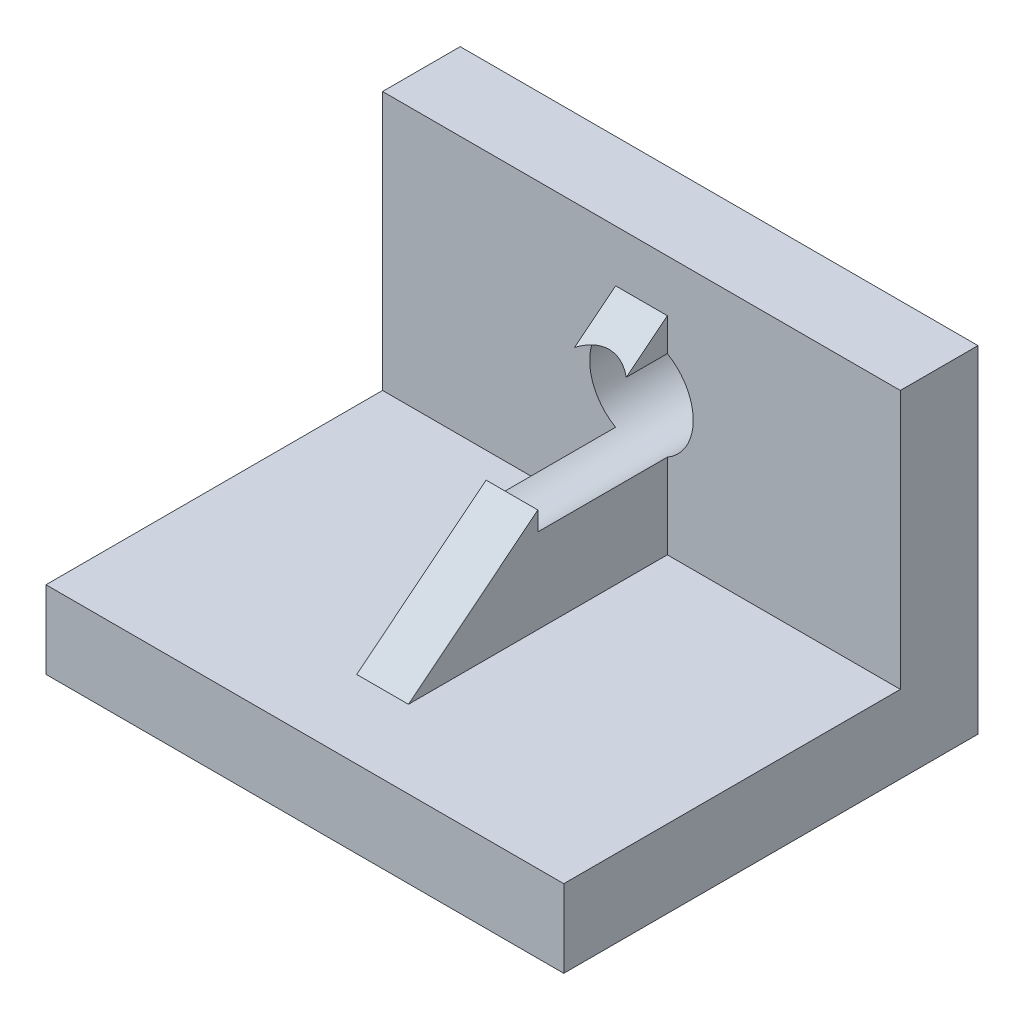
ISO-10303-21;
HEADER;
FILE_DESCRIPTION(('STEP AP214'),'2;1');
FILE_NAME('part.step','',(''),(''),'','','');
FILE_SCHEMA(('AUTOMOTIVE_DESIGN { 1 0 10303 214 1 1 1 1 }'));
ENDSEC;
DATA;
#1=APPLICATION_CONTEXT('core data for automotive mechanical design processes');
#2=APPLICATION_PROTOCOL_DEFINITION('international standard','automotive_design',2000,#1);
#3=PRODUCT_CONTEXT('',#1,'mechanical');
#4=PRODUCT('Part','Part','',(#3));
#5=PRODUCT_RELATED_PRODUCT_CATEGORY('part','',(#4));
#6=PRODUCT_DEFINITION_FORMATION('','',#4);
#7=PRODUCT_DEFINITION_CONTEXT('part definition',#1,'design');
#8=PRODUCT_DEFINITION('design','',#6,#7);
#9=PRODUCT_DEFINITION_SHAPE('','',#8);
#10=(LENGTH_UNIT() NAMED_UNIT(*) SI_UNIT(.MILLI.,.METRE.));
#11=(NAMED_UNIT(*) PLANE_ANGLE_UNIT() SI_UNIT($,.RADIAN.));
#12=(NAMED_UNIT(*) SI_UNIT($,.STERADIAN.) SOLID_ANGLE_UNIT());
#13=UNCERTAINTY_MEASURE_WITH_UNIT(LENGTH_MEASURE(1.E-05),#10,'distance_accuracy_value','');
#14=(GEOMETRIC_REPRESENTATION_CONTEXT(3) GLOBAL_UNCERTAINTY_ASSIGNED_CONTEXT((#13)) GLOBAL_UNIT_ASSIGNED_CONTEXT((#10,
#11,#12)) REPRESENTATION_CONTEXT('',''));
#15=CARTESIAN_POINT('',(0.,0.,0.));
#16=DIRECTION('',(0.,0.,1.));
#17=DIRECTION('',(1.,0.,0.));
#18=AXIS2_PLACEMENT_3D('',#15,#16,#17);
#19=CARTESIAN_POINT('',(-5.,15.,25.));
#20=DIRECTION('',(0.,0.78086880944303,0.624695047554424));
#21=DIRECTION('',(0.,-0.624695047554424,0.78086880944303));
#22=AXIS2_PLACEMENT_3D('',#19,#20,#21);
#23=PLANE('',#22);
#24=CARTESIAN_POINT('',(0.,40.,-6.24999999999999));
#25=DIRECTION('',(0.,0.78086880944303,0.624695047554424));
#26=DIRECTION('',(0.,-0.624695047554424,0.78086880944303));
#27=AXIS2_PLACEMENT_3D('',#24,#25,#26);
#28=ELLIPSE('',#27,16.0078105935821,10.);
#29=CARTESIAN_POINT('',(5.,48.6602540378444,-17.0753175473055));
#30=VERTEX_POINT('',#29);
#31=CARTESIAN_POINT('',(-5.,48.6602540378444,-17.0753175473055));
#32=VERTEX_POINT('',#31);
#33=EDGE_CURVE('E163',#30,#32,#28,.T.);
#34=ORIENTED_EDGE('',*,*,#33,.F.);
#35=DIRECTION('',(0.,-0.624695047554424,0.78086880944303));
#36=VECTOR('',#35,1.);
#37=CARTESIAN_POINT('',(5.,15.,25.));
#38=LINE('',#37,#36);
#39=CARTESIAN_POINT('',(5.,55.,-25.));
#40=VERTEX_POINT('',#39);
#41=EDGE_CURVE('E190',#40,#30,#38,.T.);
#42=ORIENTED_EDGE('',*,*,#41,.F.);
#43=DIRECTION('',(1.,0.,0.));
#44=VECTOR('',#43,1.);
#45=CARTESIAN_POINT('',(-5.,55.,-25.));
#46=LINE('',#45,#44);
#47=CARTESIAN_POINT('',(-5.,55.,-25.));
#48=VERTEX_POINT('',#47);
#49=EDGE_CURVE('E183',#48,#40,#46,.T.);
#50=ORIENTED_EDGE('',*,*,#49,.F.);
#51=DIRECTION('',(0.,-0.624695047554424,0.78086880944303));
#52=VECTOR('',#51,1.);
#53=CARTESIAN_POINT('',(-5.,15.,25.));
#54=LINE('',#53,#52);
#55=EDGE_CURVE('E176',#48,#32,#54,.T.);
#56=ORIENTED_EDGE('',*,*,#55,.T.);
#57=EDGE_LOOP('',(#34,#42,#50,#56));
#58=FACE_BOUND('',#57,.T.);
#59=ADVANCED_FACE('F41',(#58),#23,.T.);
#60=CARTESIAN_POINT('',(-5.,0.,0.));
#61=DIRECTION('',(-1.,0.,0.));
#62=DIRECTION('',(0.,0.,1.));
#63=AXIS2_PLACEMENT_3D('',#60,#61,#62);
#64=PLANE('',#63);
#65=DIRECTION('',(0.,0.,1.));
#66=VECTOR('',#65,1.);
#67=CARTESIAN_POINT('',(-5.,48.6602540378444,-50.));
#68=LINE('',#67,#66);
#69=CARTESIAN_POINT('',(-5.,48.6602540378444,-25.));
#70=VERTEX_POINT('',#69);
#71=EDGE_CURVE('E172',#32,#70,#68,.F.);
#72=ORIENTED_EDGE('',*,*,#71,.F.);
#73=ORIENTED_EDGE('',*,*,#55,.F.);
#74=DIRECTION('',(0.,1.,0.));
#75=VECTOR('',#74,1.);
#76=CARTESIAN_POINT('',(-5.,55.,-25.));
#77=LINE('',#76,#75);
#78=EDGE_CURVE('E180',#70,#48,#77,.T.);
#79=ORIENTED_EDGE('',*,*,#78,.F.);
#80=EDGE_LOOP('',(#72,#73,#79));
#81=FACE_BOUND('',#80,.T.);
#82=ADVANCED_FACE('F261',(#81),#64,.T.);
#83=CARTESIAN_POINT('',(5.,0.,0.));
#84=DIRECTION('',(-1.,0.,0.));
#85=DIRECTION('',(0.,0.,1.));
#86=AXIS2_PLACEMENT_3D('',#83,#84,#85);
#87=PLANE('',#86);
#88=ORIENTED_EDGE('',*,*,#41,.T.);
#89=DIRECTION('',(0.,0.,1.));
#90=VECTOR('',#89,1.);
#91=CARTESIAN_POINT('',(5.,48.6602540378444,-50.));
#92=LINE('',#91,#90);
#93=CARTESIAN_POINT('',(5.,48.6602540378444,-25.));
#94=VERTEX_POINT('',#93);
#95=EDGE_CURVE('E11',#30,#94,#92,.F.);
#96=ORIENTED_EDGE('',*,*,#95,.T.);
#97=DIRECTION('',(0.,1.,0.));
#98=VECTOR('',#97,1.);
#99=CARTESIAN_POINT('',(5.,55.,-25.));
#100=LINE('',#99,#98);
#101=EDGE_CURVE('E64',#94,#40,#100,.T.);
#102=ORIENTED_EDGE('',*,*,#101,.T.);
#103=EDGE_LOOP('',(#88,#96,#102));
#104=FACE_BOUND('',#103,.T.);
#105=ADVANCED_FACE('F289',(#104),#87,.F.);
#106=CARTESIAN_POINT('',(0.,15.,0.));
#107=DIRECTION('',(0.,-1.,0.));
#108=DIRECTION('',(0.,0.,-1.));
#109=AXIS2_PLACEMENT_3D('',#106,#107,#108);
#110=PLANE('',#109);
#111=DIRECTION('',(0.,0.,-1.));
#112=VECTOR('',#111,1.);
#113=CARTESIAN_POINT('',(5.,15.,-25.));
#114=LINE('',#113,#112);
#115=CARTESIAN_POINT('',(5.,15.,25.));
#116=VERTEX_POINT('',#115);
#117=CARTESIAN_POINT('',(5.,15.,-25.));
#118=VERTEX_POINT('',#117);
#119=EDGE_CURVE('E194',#116,#118,#114,.T.);
#120=ORIENTED_EDGE('',*,*,#119,.F.);
#121=DIRECTION('',(1.,0.,0.));
#122=VECTOR('',#121,1.);
#123=CARTESIAN_POINT('',(-5.,15.,25.));
#124=LINE('',#123,#122);
#125=CARTESIAN_POINT('',(-5.,15.,25.));
#126=VERTEX_POINT('',#125);
#127=EDGE_CURVE('E191',#126,#116,#124,.T.);
#128=ORIENTED_EDGE('',*,*,#127,.F.);
#129=DIRECTION('',(0.,0.,-1.));
#130=VECTOR('',#129,1.);
#131=CARTESIAN_POINT('',(-5.,15.,-25.));
#132=LINE('',#131,#130);
#133=CARTESIAN_POINT('',(-5.,15.,-25.));
#134=VERTEX_POINT('',#133);
#135=EDGE_CURVE('E185',#126,#134,#132,.T.);
#136=ORIENTED_EDGE('',*,*,#135,.T.);
#137=DIRECTION('',(1.,0.,0.));
#138=VECTOR('',#137,1.);
#139=CARTESIAN_POINT('',(-50.,15.,-25.));
#140=LINE('',#139,#138);
#141=CARTESIAN_POINT('',(-50.,15.,-25.));
#142=VERTEX_POINT('',#141);
#143=EDGE_CURVE('E204',#142,#134,#140,.T.);
#144=ORIENTED_EDGE('',*,*,#143,.F.);
#145=DIRECTION('',(0.,0.,1.));
#146=VECTOR('',#145,1.);
#147=CARTESIAN_POINT('',(-50.,15.,40.));
#148=LINE('',#147,#146);
#149=CARTESIAN_POINT('',(-50.,15.,40.));
#150=VERTEX_POINT('',#149);
#151=EDGE_CURVE('E224',#142,#150,#148,.T.);
#152=ORIENTED_EDGE('',*,*,#151,.T.);
#153=DIRECTION('',(1.,0.,0.));
#154=VECTOR('',#153,1.);
#155=CARTESIAN_POINT('',(-50.,15.,40.));
#156=LINE('',#155,#154);
#157=CARTESIAN_POINT('',(50.,15.,40.));
#158=VERTEX_POINT('',#157);
#159=EDGE_CURVE('E226',#150,#158,#156,.T.);
#160=ORIENTED_EDGE('',*,*,#159,.T.);
#161=DIRECTION('',(0.,0.,-1.));
#162=VECTOR('',#161,1.);
#163=CARTESIAN_POINT('',(50.,15.,40.));
#164=LINE('',#163,#162);
#165=CARTESIAN_POINT('',(50.,15.,-25.));
#166=VERTEX_POINT('',#165);
#167=EDGE_CURVE('E219',#158,#166,#164,.T.);
#168=ORIENTED_EDGE('',*,*,#167,.T.);
#169=EDGE_CURVE('E197',#118,#166,#140,.T.);
#170=ORIENTED_EDGE('',*,*,#169,.F.);
#171=EDGE_LOOP('',(#120,#128,#136,#144,#152,#160,#168,#170));
#172=FACE_BOUND('',#171,.T.);
#173=ADVANCED_FACE('F264',(#172),#110,.F.);
#174=CARTESIAN_POINT('',(-50.,65.,-25.));
#175=DIRECTION('',(0.,0.,-1.));
#176=DIRECTION('',(-1.,0.,0.));
#177=AXIS2_PLACEMENT_3D('',#174,#175,#176);
#178=PLANE('',#177);
#179=ORIENTED_EDGE('',*,*,#101,.F.);
#180=CARTESIAN_POINT('',(0.,40.,-25.));
#181=DIRECTION('',(0.,0.,-1.));
#182=DIRECTION('',(-1.,0.,0.));
#183=AXIS2_PLACEMENT_3D('',#180,#181,#182);
#184=CIRCLE('',#183,10.);
#185=CARTESIAN_POINT('',(5.,31.3397459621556,-25.));
#186=VERTEX_POINT('',#185);
#187=EDGE_CURVE('E167',#94,#186,#184,.T.);
#188=ORIENTED_EDGE('',*,*,#187,.T.);
#189=EDGE_CURVE('E186',#118,#186,#100,.T.);
#190=ORIENTED_EDGE('',*,*,#189,.F.);
#191=ORIENTED_EDGE('',*,*,#169,.T.);
#192=DIRECTION('',(0.,-1.,0.));
#193=VECTOR('',#192,1.);
#194=CARTESIAN_POINT('',(50.,65.,-25.));
#195=LINE('',#194,#193);
#196=CARTESIAN_POINT('',(50.,65.,-25.));
#197=VERTEX_POINT('',#196);
#198=EDGE_CURVE('E211',#197,#166,#195,.T.);
#199=ORIENTED_EDGE('',*,*,#198,.F.);
#200=DIRECTION('',(1.,0.,0.));
#201=VECTOR('',#200,1.);
#202=CARTESIAN_POINT('',(-50.,65.,-25.));
#203=LINE('',#202,#201);
#204=CARTESIAN_POINT('',(-50.,65.,-25.));
#205=VERTEX_POINT('',#204);
#206=EDGE_CURVE('E207',#205,#197,#203,.T.);
#207=ORIENTED_EDGE('',*,*,#206,.F.);
#208=DIRECTION('',(0.,-1.,0.));
#209=VECTOR('',#208,1.);
#210=CARTESIAN_POINT('',(-50.,65.,-25.));
#211=LINE('',#210,#209);
#212=EDGE_CURVE('E216',#205,#142,#211,.T.);
#213=ORIENTED_EDGE('',*,*,#212,.T.);
#214=ORIENTED_EDGE('',*,*,#143,.T.);
#215=CARTESIAN_POINT('',(-5.,31.3397459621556,-25.));
#216=VERTEX_POINT('',#215);
#217=EDGE_CURVE('E177',#134,#216,#77,.T.);
#218=ORIENTED_EDGE('',*,*,#217,.T.);
#219=EDGE_CURVE('E147',#216,#70,#184,.T.);
#220=ORIENTED_EDGE('',*,*,#219,.T.);
#221=ORIENTED_EDGE('',*,*,#78,.T.);
#222=ORIENTED_EDGE('',*,*,#49,.T.);
#223=EDGE_LOOP('',(#179,#188,#190,#191,#199,#207,#213,#214,#218,#220,#221,#222));
#224=FACE_BOUND('',#223,.T.);
#225=ADVANCED_FACE('F252',(#224),#178,.F.);
#226=CARTESIAN_POINT('',(50.,15.,40.));
#227=DIRECTION('',(-1.,0.,0.));
#228=DIRECTION('',(0.,0.,1.));
#229=AXIS2_PLACEMENT_3D('',#226,#227,#228);
#230=PLANE('',#229);
#231=DIRECTION('',(0.,0.,-1.));
#232=VECTOR('',#231,1.);
#233=CARTESIAN_POINT('',(50.,0.,40.));
#234=LINE('',#233,#232);
#235=CARTESIAN_POINT('',(50.,0.,40.));
#236=VERTEX_POINT('',#235);
#237=CARTESIAN_POINT('',(50.,0.,-40.));
#238=VERTEX_POINT('',#237);
#239=EDGE_CURVE('E218',#236,#238,#234,.T.);
#240=ORIENTED_EDGE('',*,*,#239,.T.);
#241=DIRECTION('',(0.,-1.,0.));
#242=VECTOR('',#241,1.);
#243=CARTESIAN_POINT('',(50.,15.,-40.));
#244=LINE('',#243,#242);
#245=CARTESIAN_POINT('',(50.,65.,-40.));
#246=VERTEX_POINT('',#245);
#247=EDGE_CURVE('E243',#246,#238,#244,.T.);
#248=ORIENTED_EDGE('',*,*,#247,.F.);
#249=DIRECTION('',(0.,0.,-1.));
#250=VECTOR('',#249,1.);
#251=CARTESIAN_POINT('',(50.,65.,-25.));
#252=LINE('',#251,#250);
#253=EDGE_CURVE('E199',#197,#246,#252,.T.);
#254=ORIENTED_EDGE('',*,*,#253,.F.);
#255=ORIENTED_EDGE('',*,*,#198,.T.);
#256=ORIENTED_EDGE('',*,*,#167,.F.);
#257=DIRECTION('',(0.,-1.,0.));
#258=VECTOR('',#257,1.);
#259=CARTESIAN_POINT('',(50.,15.,40.));
#260=LINE('',#259,#258);
#261=EDGE_CURVE('E229',#158,#236,#260,.T.);
#262=ORIENTED_EDGE('',*,*,#261,.T.);
#263=EDGE_LOOP('',(#240,#248,#254,#255,#256,#262));
#264=FACE_BOUND('',#263,.T.);
#265=ADVANCED_FACE('F43',(#264),#230,.F.);
#266=CARTESIAN_POINT('',(-50.,15.,-40.));
#267=DIRECTION('',(0.,0.,1.));
#268=DIRECTION('',(1.,0.,0.));
#269=AXIS2_PLACEMENT_3D('',#266,#267,#268);
#270=PLANE('',#269);
#271=CARTESIAN_POINT('',(0.,40.,-40.));
#272=DIRECTION('',(0.,0.,1.));
#273=DIRECTION('',(1.,0.,0.));
#274=AXIS2_PLACEMENT_3D('',#271,#272,#273);
#275=CIRCLE('',#274,10.);
#276=CARTESIAN_POINT('',(10.,40.,-40.));
#277=VERTEX_POINT('',#276);
#278=EDGE_CURVE('E152',#277,#277,#275,.T.);
#279=ORIENTED_EDGE('',*,*,#278,.T.);
#280=EDGE_LOOP('',(#279));
#281=FACE_BOUND('',#280,.T.);
#282=DIRECTION('',(-1.,0.,0.));
#283=VECTOR('',#282,1.);
#284=CARTESIAN_POINT('',(-50.,0.,-40.));
#285=LINE('',#284,#283);
#286=CARTESIAN_POINT('',(-50.,0.,-40.));
#287=VERTEX_POINT('',#286);
#288=EDGE_CURVE('E232',#238,#287,#285,.T.);
#289=ORIENTED_EDGE('',*,*,#288,.T.);
#290=DIRECTION('',(0.,-1.,0.));
#291=VECTOR('',#290,1.);
#292=CARTESIAN_POINT('',(-50.,15.,-40.));
#293=LINE('',#292,#291);
#294=CARTESIAN_POINT('',(-50.,65.,-40.));
#295=VERTEX_POINT('',#294);
#296=EDGE_CURVE('E241',#295,#287,#293,.T.);
#297=ORIENTED_EDGE('',*,*,#296,.F.);
#298=DIRECTION('',(-1.,0.,0.));
#299=VECTOR('',#298,1.);
#300=CARTESIAN_POINT('',(-50.,65.,-40.));
#301=LINE('',#300,#299);
#302=EDGE_CURVE('E201',#246,#295,#301,.T.);
#303=ORIENTED_EDGE('',*,*,#302,.F.);
#304=ORIENTED_EDGE('',*,*,#247,.T.);
#305=EDGE_LOOP('',(#289,#297,#303,#304));
#306=FACE_BOUND('',#305,.T.);
#307=ADVANCED_FACE('F368',(#281,#306),#270,.F.);
#308=CARTESIAN_POINT('',(-50.,15.,40.));
#309=DIRECTION('',(1.,0.,0.));
#310=DIRECTION('',(0.,0.,-1.));
#311=AXIS2_PLACEMENT_3D('',#308,#309,#310);
#312=PLANE('',#311);
#313=DIRECTION('',(0.,0.,1.));
#314=VECTOR('',#313,1.);
#315=CARTESIAN_POINT('',(-50.,0.,40.));
#316=LINE('',#315,#314);
#317=CARTESIAN_POINT('',(-50.,0.,40.));
#318=VERTEX_POINT('',#317);
#319=EDGE_CURVE('E235',#287,#318,#316,.T.);
#320=ORIENTED_EDGE('',*,*,#319,.T.);
#321=DIRECTION('',(0.,-1.,0.));
#322=VECTOR('',#321,1.);
#323=CARTESIAN_POINT('',(-50.,15.,40.));
#324=LINE('',#323,#322);
#325=EDGE_CURVE('E236',#150,#318,#324,.T.);
#326=ORIENTED_EDGE('',*,*,#325,.F.);
#327=ORIENTED_EDGE('',*,*,#151,.F.);
#328=ORIENTED_EDGE('',*,*,#212,.F.);
#329=DIRECTION('',(0.,0.,1.));
#330=VECTOR('',#329,1.);
#331=CARTESIAN_POINT('',(-50.,65.,-25.));
#332=LINE('',#331,#330);
#333=EDGE_CURVE('E210',#295,#205,#332,.T.);
#334=ORIENTED_EDGE('',*,*,#333,.F.);
#335=ORIENTED_EDGE('',*,*,#296,.T.);
#336=EDGE_LOOP('',(#320,#326,#327,#328,#334,#335));
#337=FACE_BOUND('',#336,.T.);
#338=ADVANCED_FACE('F358',(#337),#312,.F.);
#339=CARTESIAN_POINT('',(-50.,15.,40.));
#340=DIRECTION('',(0.,0.,-1.));
#341=DIRECTION('',(-1.,0.,0.));
#342=AXIS2_PLACEMENT_3D('',#339,#340,#341);
#343=PLANE('',#342);
#344=DIRECTION('',(1.,0.,0.));
#345=VECTOR('',#344,1.);
#346=CARTESIAN_POINT('',(-50.,0.,40.));
#347=LINE('',#346,#345);
#348=EDGE_CURVE('E221',#318,#236,#347,.T.);
#349=ORIENTED_EDGE('',*,*,#348,.T.);
#350=ORIENTED_EDGE('',*,*,#261,.F.);
#351=ORIENTED_EDGE('',*,*,#159,.F.);
#352=ORIENTED_EDGE('',*,*,#325,.T.);
#353=EDGE_LOOP('',(#349,#350,#351,#352));
#354=FACE_BOUND('',#353,.T.);
#355=ADVANCED_FACE('F364',(#354),#343,.F.);
#356=CARTESIAN_POINT('',(0.,0.,0.));
#357=DIRECTION('',(0.,-1.,0.));
#358=DIRECTION('',(0.,0.,-1.));
#359=AXIS2_PLACEMENT_3D('',#356,#357,#358);
#360=PLANE('',#359);
#361=ORIENTED_EDGE('',*,*,#239,.F.);
#362=ORIENTED_EDGE('',*,*,#348,.F.);
#363=ORIENTED_EDGE('',*,*,#319,.F.);
#364=ORIENTED_EDGE('',*,*,#288,.F.);
#365=EDGE_LOOP('',(#361,#362,#363,#364));
#366=FACE_BOUND('',#365,.T.);
#367=ADVANCED_FACE('F279',(#366),#360,.T.);
#368=CARTESIAN_POINT('',(0.,65.,0.));
#369=DIRECTION('',(0.,-1.,0.));
#370=DIRECTION('',(0.,0.,-1.));
#371=AXIS2_PLACEMENT_3D('',#368,#369,#370);
#372=PLANE('',#371);
#373=ORIENTED_EDGE('',*,*,#253,.T.);
#374=ORIENTED_EDGE('',*,*,#302,.T.);
#375=ORIENTED_EDGE('',*,*,#333,.T.);
#376=ORIENTED_EDGE('',*,*,#206,.T.);
#377=EDGE_LOOP('',(#373,#374,#375,#376));
#378=FACE_BOUND('',#377,.T.);
#379=ADVANCED_FACE('F269',(#378),#372,.F.);
#380=DIRECTION('',(1.,0.,0.));
#381=VECTOR('',#380,1.);
#382=CARTESIAN_POINT('',(-5.,35.,0.));
#383=LINE('',#382,#381);
#384=CARTESIAN_POINT('',(-5.,35.,0.));
#385=VERTEX_POINT('',#384);
#386=CARTESIAN_POINT('',(5.,35.,0.));
#387=VERTEX_POINT('',#386);
#388=EDGE_CURVE('E57',#385,#387,#383,.T.);
#389=ORIENTED_EDGE('',*,*,#388,.F.);
#390=EDGE_CURVE('E162',#385,#126,#54,.T.);
#391=ORIENTED_EDGE('',*,*,#390,.T.);
#392=ORIENTED_EDGE('',*,*,#127,.T.);
#393=EDGE_CURVE('E188',#387,#116,#38,.T.);
#394=ORIENTED_EDGE('',*,*,#393,.F.);
#395=EDGE_LOOP('',(#389,#391,#392,#394));
#396=FACE_BOUND('',#395,.T.);
#397=ADVANCED_FACE('F268',(#396),#23,.T.);
#398=DIRECTION('',(0.,0.,1.));
#399=VECTOR('',#398,1.);
#400=CARTESIAN_POINT('',(-5.,31.3397459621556,-50.));
#401=LINE('',#400,#399);
#402=CARTESIAN_POINT('',(-5.,31.3397459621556,0.));
#403=VERTEX_POINT('',#402);
#404=EDGE_CURVE('E141',#216,#403,#401,.T.);
#405=ORIENTED_EDGE('',*,*,#404,.F.);
#406=ORIENTED_EDGE('',*,*,#217,.F.);
#407=ORIENTED_EDGE('',*,*,#135,.F.);
#408=ORIENTED_EDGE('',*,*,#390,.F.);
#409=DIRECTION('',(0.,1.,0.));
#410=VECTOR('',#409,1.);
#411=CARTESIAN_POINT('',(-5.,0.,0.));
#412=LINE('',#411,#410);
#413=EDGE_CURVE('E160',#403,#385,#412,.T.);
#414=ORIENTED_EDGE('',*,*,#413,.F.);
#415=EDGE_LOOP('',(#405,#406,#407,#408,#414));
#416=FACE_BOUND('',#415,.T.);
#417=ADVANCED_FACE('F161',(#416),#64,.T.);
#418=ORIENTED_EDGE('',*,*,#189,.T.);
#419=DIRECTION('',(0.,0.,1.));
#420=VECTOR('',#419,1.);
#421=CARTESIAN_POINT('',(5.,31.3397459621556,-50.));
#422=LINE('',#421,#420);
#423=CARTESIAN_POINT('',(5.,31.3397459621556,0.));
#424=VERTEX_POINT('',#423);
#425=EDGE_CURVE('E47',#186,#424,#422,.T.);
#426=ORIENTED_EDGE('',*,*,#425,.T.);
#427=DIRECTION('',(0.,1.,0.));
#428=VECTOR('',#427,1.);
#429=CARTESIAN_POINT('',(5.,0.,0.));
#430=LINE('',#429,#428);
#431=EDGE_CURVE('E158',#424,#387,#430,.T.);
#432=ORIENTED_EDGE('',*,*,#431,.T.);
#433=ORIENTED_EDGE('',*,*,#393,.T.);
#434=ORIENTED_EDGE('',*,*,#119,.T.);
#435=EDGE_LOOP('',(#418,#426,#432,#433,#434));
#436=FACE_BOUND('',#435,.T.);
#437=ADVANCED_FACE('F250',(#436),#87,.F.);
#438=CARTESIAN_POINT('',(0.,40.,-50.));
#439=DIRECTION('',(0.,0.,1.));
#440=DIRECTION('',(1.,0.,0.));
#441=AXIS2_PLACEMENT_3D('',#438,#439,#440);
#442=CYLINDRICAL_SURFACE('',#441,10.);
#443=ORIENTED_EDGE('',*,*,#404,.T.);
#444=CARTESIAN_POINT('',(0.,40.,0.));
#445=DIRECTION('',(0.,0.,1.));
#446=DIRECTION('',(1.,0.,0.));
#447=AXIS2_PLACEMENT_3D('',#444,#445,#446);
#448=CIRCLE('',#447,10.);
#449=EDGE_CURVE('E150',#403,#424,#448,.T.);
#450=ORIENTED_EDGE('',*,*,#449,.T.);
#451=ORIENTED_EDGE('',*,*,#425,.F.);
#452=ORIENTED_EDGE('',*,*,#187,.F.);
#453=ORIENTED_EDGE('',*,*,#95,.F.);
#454=ORIENTED_EDGE('',*,*,#33,.T.);
#455=ORIENTED_EDGE('',*,*,#71,.T.);
#456=ORIENTED_EDGE('',*,*,#219,.F.);
#457=EDGE_LOOP('',(#443,#450,#451,#452,#453,#454,#455,#456));
#458=FACE_BOUND('',#457,.T.);
#459=ORIENTED_EDGE('',*,*,#278,.F.);
#460=EDGE_LOOP('',(#459));
#461=FACE_BOUND('',#460,.T.);
#462=ADVANCED_FACE('F144',(#458,#461),#442,.F.);
#463=CARTESIAN_POINT('',(0.,40.,0.));
#464=DIRECTION('',(0.,0.,1.));
#465=DIRECTION('',(1.,0.,0.));
#466=AXIS2_PLACEMENT_3D('',#463,#464,#465);
#467=PLANE('',#466);
#468=ORIENTED_EDGE('',*,*,#413,.T.);
#469=ORIENTED_EDGE('',*,*,#388,.T.);
#470=ORIENTED_EDGE('',*,*,#431,.F.);
#471=ORIENTED_EDGE('',*,*,#449,.F.);
#472=EDGE_LOOP('',(#468,#469,#470,#471));
#473=FACE_BOUND('',#472,.T.);
#474=ADVANCED_FACE('F156',(#473),#467,.F.);
#475=CLOSED_SHELL('',(#59,#82,#105,#173,#225,#265,#307,#338,#355,#367,#379,#397,#417,#437,#462,#474));
#476=MANIFOLD_SOLID_BREP('B2',#475);
#477=ADVANCED_BREP_SHAPE_REPRESENTATION('',(#18,#476),#14);
#478=SHAPE_DEFINITION_REPRESENTATION(#9,#477);
ENDSEC;
END-ISO-10303-21;
